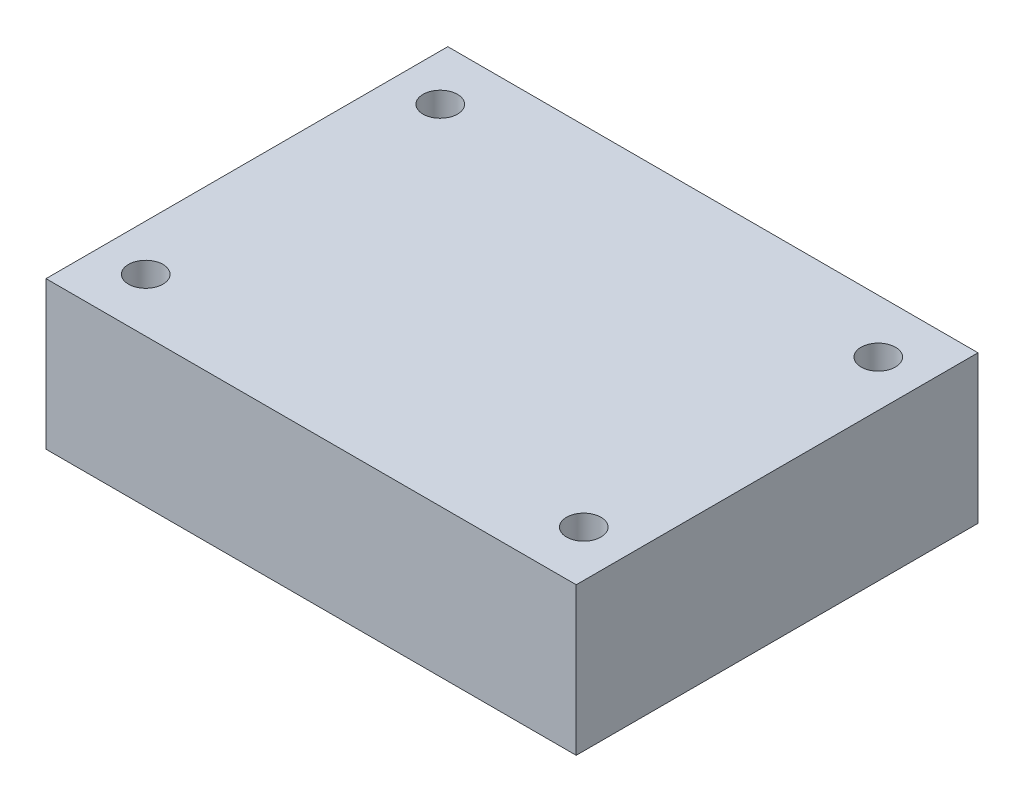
ISO-10303-21;
HEADER;
FILE_DESCRIPTION(('STEP AP214'),'2;1');
FILE_NAME('part.step','',(''),(''),'','','');
FILE_SCHEMA(('AUTOMOTIVE_DESIGN { 1 0 10303 214 1 1 1 1 }'));
ENDSEC;
DATA;
#1=APPLICATION_CONTEXT('core data for automotive mechanical design processes');
#2=APPLICATION_PROTOCOL_DEFINITION('international standard','automotive_design',2000,#1);
#3=PRODUCT_CONTEXT('',#1,'mechanical');
#4=PRODUCT('Part','Part','',(#3));
#5=PRODUCT_RELATED_PRODUCT_CATEGORY('part','',(#4));
#6=PRODUCT_DEFINITION_FORMATION('','',#4);
#7=PRODUCT_DEFINITION_CONTEXT('part definition',#1,'design');
#8=PRODUCT_DEFINITION('design','',#6,#7);
#9=PRODUCT_DEFINITION_SHAPE('','',#8);
#10=(LENGTH_UNIT() NAMED_UNIT(*) SI_UNIT(.MILLI.,.METRE.));
#11=(NAMED_UNIT(*) PLANE_ANGLE_UNIT() SI_UNIT($,.RADIAN.));
#12=(NAMED_UNIT(*) SI_UNIT($,.STERADIAN.) SOLID_ANGLE_UNIT());
#13=UNCERTAINTY_MEASURE_WITH_UNIT(LENGTH_MEASURE(1.E-05),#10,'distance_accuracy_value','');
#14=(GEOMETRIC_REPRESENTATION_CONTEXT(3) GLOBAL_UNCERTAINTY_ASSIGNED_CONTEXT((#13)) GLOBAL_UNIT_ASSIGNED_CONTEXT((#10,
#11,#12)) REPRESENTATION_CONTEXT('',''));
#15=CARTESIAN_POINT('',(0.,0.,0.));
#16=DIRECTION('',(0.,0.,1.));
#17=DIRECTION('',(1.,0.,0.));
#18=AXIS2_PLACEMENT_3D('',#15,#16,#17);
#19=CARTESIAN_POINT('',(73.3773642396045,40.894,-55.6055345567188));
#20=DIRECTION('',(-1.,0.,0.));
#21=DIRECTION('',(0.,0.,1.));
#22=AXIS2_PLACEMENT_3D('',#19,#20,#21);
#23=PLANE('',#22);
#24=DIRECTION('',(0.,0.,-1.));
#25=VECTOR('',#24,1.);
#26=CARTESIAN_POINT('',(73.3773642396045,0.,-55.6055345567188));
#27=LINE('',#26,#25);
#28=CARTESIAN_POINT('',(73.3773642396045,0.,55.6055345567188));
#29=VERTEX_POINT('',#28);
#30=CARTESIAN_POINT('',(73.3773642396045,0.,-55.6055345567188));
#31=VERTEX_POINT('',#30);
#32=EDGE_CURVE('E96',#29,#31,#27,.T.);
#33=ORIENTED_EDGE('',*,*,#32,.T.);
#34=DIRECTION('',(0.,-1.,0.));
#35=VECTOR('',#34,1.);
#36=CARTESIAN_POINT('',(73.3773642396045,40.894,-55.6055345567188));
#37=LINE('',#36,#35);
#38=CARTESIAN_POINT('',(73.3773642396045,40.894,-55.6055345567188));
#39=VERTEX_POINT('',#38);
#40=EDGE_CURVE('E11',#39,#31,#37,.T.);
#41=ORIENTED_EDGE('',*,*,#40,.F.);
#42=DIRECTION('',(0.,0.,-1.));
#43=VECTOR('',#42,1.);
#44=CARTESIAN_POINT('',(73.3773642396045,40.894,-55.6055345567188));
#45=LINE('',#44,#43);
#46=CARTESIAN_POINT('',(73.3773642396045,40.894,55.6055345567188));
#47=VERTEX_POINT('',#46);
#48=EDGE_CURVE('E84',#47,#39,#45,.T.);
#49=ORIENTED_EDGE('',*,*,#48,.F.);
#50=DIRECTION('',(0.,-1.,0.));
#51=VECTOR('',#50,1.);
#52=CARTESIAN_POINT('',(73.3773642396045,40.894,55.6055345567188));
#53=LINE('',#52,#51);
#54=EDGE_CURVE('E92',#47,#29,#53,.T.);
#55=ORIENTED_EDGE('',*,*,#54,.T.);
#56=EDGE_LOOP('',(#33,#41,#49,#55));
#57=FACE_BOUND('',#56,.T.);
#58=ADVANCED_FACE('F33',(#57),#23,.F.);
#59=CARTESIAN_POINT('',(-73.3773642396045,40.894,-55.6055345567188));
#60=DIRECTION('',(0.,0.,1.));
#61=DIRECTION('',(1.,0.,0.));
#62=AXIS2_PLACEMENT_3D('',#59,#60,#61);
#63=PLANE('',#62);
#64=DIRECTION('',(-1.,0.,0.));
#65=VECTOR('',#64,1.);
#66=CARTESIAN_POINT('',(-73.3773642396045,0.,-55.6055345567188));
#67=LINE('',#66,#65);
#68=CARTESIAN_POINT('',(-73.3773642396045,0.,-55.6055345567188));
#69=VERTEX_POINT('',#68);
#70=EDGE_CURVE('E88',#31,#69,#67,.T.);
#71=ORIENTED_EDGE('',*,*,#70,.T.);
#72=DIRECTION('',(0.,-1.,0.));
#73=VECTOR('',#72,1.);
#74=CARTESIAN_POINT('',(-73.3773642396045,40.894,-55.6055345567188));
#75=LINE('',#74,#73);
#76=CARTESIAN_POINT('',(-73.3773642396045,40.894,-55.6055345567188));
#77=VERTEX_POINT('',#76);
#78=EDGE_CURVE('E41',#77,#69,#75,.T.);
#79=ORIENTED_EDGE('',*,*,#78,.F.);
#80=DIRECTION('',(-1.,0.,0.));
#81=VECTOR('',#80,1.);
#82=CARTESIAN_POINT('',(-73.3773642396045,40.894,-55.6055345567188));
#83=LINE('',#82,#81);
#84=EDGE_CURVE('E79',#39,#77,#83,.T.);
#85=ORIENTED_EDGE('',*,*,#84,.F.);
#86=ORIENTED_EDGE('',*,*,#40,.T.);
#87=EDGE_LOOP('',(#71,#79,#85,#86));
#88=FACE_BOUND('',#87,.T.);
#89=ADVANCED_FACE('F87',(#88),#63,.F.);
#90=CARTESIAN_POINT('',(-73.3773642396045,40.894,-55.6055345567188));
#91=DIRECTION('',(1.,0.,0.));
#92=DIRECTION('',(0.,0.,-1.));
#93=AXIS2_PLACEMENT_3D('',#90,#91,#92);
#94=PLANE('',#93);
#95=DIRECTION('',(0.,0.,1.));
#96=VECTOR('',#95,1.);
#97=CARTESIAN_POINT('',(-73.3773642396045,0.,-55.6055345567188));
#98=LINE('',#97,#96);
#99=CARTESIAN_POINT('',(-73.3773642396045,0.,55.6055345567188));
#100=VERTEX_POINT('',#99);
#101=EDGE_CURVE('E66',#69,#100,#98,.T.);
#102=ORIENTED_EDGE('',*,*,#101,.T.);
#103=DIRECTION('',(0.,-1.,0.));
#104=VECTOR('',#103,1.);
#105=CARTESIAN_POINT('',(-73.3773642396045,40.894,55.6055345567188));
#106=LINE('',#105,#104);
#107=CARTESIAN_POINT('',(-73.3773642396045,40.894,55.6055345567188));
#108=VERTEX_POINT('',#107);
#109=EDGE_CURVE('E89',#108,#100,#106,.T.);
#110=ORIENTED_EDGE('',*,*,#109,.F.);
#111=DIRECTION('',(0.,0.,1.));
#112=VECTOR('',#111,1.);
#113=CARTESIAN_POINT('',(-73.3773642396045,40.894,-55.6055345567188));
#114=LINE('',#113,#112);
#115=EDGE_CURVE('E82',#77,#108,#114,.T.);
#116=ORIENTED_EDGE('',*,*,#115,.F.);
#117=ORIENTED_EDGE('',*,*,#78,.T.);
#118=EDGE_LOOP('',(#102,#110,#116,#117));
#119=FACE_BOUND('',#118,.T.);
#120=ADVANCED_FACE('F90',(#119),#94,.F.);
#121=CARTESIAN_POINT('',(-73.3773642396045,40.894,55.6055345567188));
#122=DIRECTION('',(0.,0.,-1.));
#123=DIRECTION('',(-1.,0.,0.));
#124=AXIS2_PLACEMENT_3D('',#121,#122,#123);
#125=PLANE('',#124);
#126=DIRECTION('',(1.,0.,0.));
#127=VECTOR('',#126,1.);
#128=CARTESIAN_POINT('',(-73.3773642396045,0.,55.6055345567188));
#129=LINE('',#128,#127);
#130=EDGE_CURVE('E72',#100,#29,#129,.T.);
#131=ORIENTED_EDGE('',*,*,#130,.T.);
#132=ORIENTED_EDGE('',*,*,#54,.F.);
#133=DIRECTION('',(1.,0.,0.));
#134=VECTOR('',#133,1.);
#135=CARTESIAN_POINT('',(-73.3773642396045,40.894,55.6055345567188));
#136=LINE('',#135,#134);
#137=EDGE_CURVE('E49',#108,#47,#136,.T.);
#138=ORIENTED_EDGE('',*,*,#137,.F.);
#139=ORIENTED_EDGE('',*,*,#109,.T.);
#140=EDGE_LOOP('',(#131,#132,#138,#139));
#141=FACE_BOUND('',#140,.T.);
#142=ADVANCED_FACE('F104',(#141),#125,.F.);
#143=CARTESIAN_POINT('',(0.,40.894,0.));
#144=DIRECTION('',(0.,1.,0.));
#145=DIRECTION('',(0.,0.,1.));
#146=AXIS2_PLACEMENT_3D('',#143,#144,#145);
#147=PLANE('',#146);
#148=CARTESIAN_POINT('',(60.617854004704,40.894,40.7604096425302));
#149=DIRECTION('',(0.,1.,0.));
#150=DIRECTION('',(0.,0.,1.));
#151=AXIS2_PLACEMENT_3D('',#148,#149,#150);
#152=CIRCLE('',#151,4.7625);
#153=CARTESIAN_POINT('',(60.617854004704,40.894,45.5229096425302));
#154=VERTEX_POINT('',#153);
#155=EDGE_CURVE('E128',#154,#154,#152,.T.);
#156=ORIENTED_EDGE('',*,*,#155,.F.);
#157=EDGE_LOOP('',(#156));
#158=FACE_BOUND('',#157,.T.);
#159=CARTESIAN_POINT('',(-60.617854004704,40.894,40.7604096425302));
#160=DIRECTION('',(0.,1.,0.));
#161=DIRECTION('',(0.,0.,-1.));
#162=AXIS2_PLACEMENT_3D('',#159,#160,#161);
#163=CIRCLE('',#162,4.7625);
#164=CARTESIAN_POINT('',(-60.617854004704,40.894,35.9979096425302));
#165=VERTEX_POINT('',#164);
#166=EDGE_CURVE('E122',#165,#165,#163,.T.);
#167=ORIENTED_EDGE('',*,*,#166,.F.);
#168=EDGE_LOOP('',(#167));
#169=FACE_BOUND('',#168,.T.);
#170=CARTESIAN_POINT('',(60.617854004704,40.894,-40.7604096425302));
#171=DIRECTION('',(0.,1.,0.));
#172=DIRECTION('',(0.,0.,-1.));
#173=AXIS2_PLACEMENT_3D('',#170,#171,#172);
#174=CIRCLE('',#173,4.7625);
#175=CARTESIAN_POINT('',(60.617854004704,40.894,-45.5229096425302));
#176=VERTEX_POINT('',#175);
#177=EDGE_CURVE('E116',#176,#176,#174,.T.);
#178=ORIENTED_EDGE('',*,*,#177,.F.);
#179=EDGE_LOOP('',(#178));
#180=FACE_BOUND('',#179,.T.);
#181=CARTESIAN_POINT('',(-60.617854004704,40.894,-40.7604096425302));
#182=DIRECTION('',(0.,1.,0.));
#183=DIRECTION('',(0.,0.,1.));
#184=AXIS2_PLACEMENT_3D('',#181,#182,#183);
#185=CIRCLE('',#184,4.7625);
#186=CARTESIAN_POINT('',(-60.617854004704,40.894,-35.9979096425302));
#187=VERTEX_POINT('',#186);
#188=EDGE_CURVE('E110',#187,#187,#185,.T.);
#189=ORIENTED_EDGE('',*,*,#188,.F.);
#190=EDGE_LOOP('',(#189));
#191=FACE_BOUND('',#190,.T.);
#192=ORIENTED_EDGE('',*,*,#48,.T.);
#193=ORIENTED_EDGE('',*,*,#84,.T.);
#194=ORIENTED_EDGE('',*,*,#115,.T.);
#195=ORIENTED_EDGE('',*,*,#137,.T.);
#196=EDGE_LOOP('',(#192,#193,#194,#195));
#197=FACE_BOUND('',#196,.T.);
#198=ADVANCED_FACE('F80',(#158,#169,#180,#191,#197),#147,.T.);
#199=CARTESIAN_POINT('',(0.,0.,0.));
#200=DIRECTION('',(0.,1.,0.));
#201=DIRECTION('',(0.,0.,1.));
#202=AXIS2_PLACEMENT_3D('',#199,#200,#201);
#203=PLANE('',#202);
#204=CARTESIAN_POINT('',(60.617854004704,0.,40.7604096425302));
#205=DIRECTION('',(0.,1.,0.));
#206=DIRECTION('',(0.,0.,1.));
#207=AXIS2_PLACEMENT_3D('',#204,#205,#206);
#208=CIRCLE('',#207,4.7625);
#209=CARTESIAN_POINT('',(60.617854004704,0.,45.5229096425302));
#210=VERTEX_POINT('',#209);
#211=EDGE_CURVE('E125',#210,#210,#208,.T.);
#212=ORIENTED_EDGE('',*,*,#211,.T.);
#213=EDGE_LOOP('',(#212));
#214=FACE_BOUND('',#213,.T.);
#215=CARTESIAN_POINT('',(-60.617854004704,0.,40.7604096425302));
#216=DIRECTION('',(0.,1.,0.));
#217=DIRECTION('',(0.,0.,-1.));
#218=AXIS2_PLACEMENT_3D('',#215,#216,#217);
#219=CIRCLE('',#218,4.7625);
#220=CARTESIAN_POINT('',(-60.617854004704,0.,35.9979096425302));
#221=VERTEX_POINT('',#220);
#222=EDGE_CURVE('E119',#221,#221,#219,.T.);
#223=ORIENTED_EDGE('',*,*,#222,.T.);
#224=EDGE_LOOP('',(#223));
#225=FACE_BOUND('',#224,.T.);
#226=CARTESIAN_POINT('',(60.617854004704,0.,-40.7604096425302));
#227=DIRECTION('',(0.,1.,0.));
#228=DIRECTION('',(0.,0.,-1.));
#229=AXIS2_PLACEMENT_3D('',#226,#227,#228);
#230=CIRCLE('',#229,4.7625);
#231=CARTESIAN_POINT('',(60.617854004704,0.,-45.5229096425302));
#232=VERTEX_POINT('',#231);
#233=EDGE_CURVE('E113',#232,#232,#230,.T.);
#234=ORIENTED_EDGE('',*,*,#233,.T.);
#235=EDGE_LOOP('',(#234));
#236=FACE_BOUND('',#235,.T.);
#237=CARTESIAN_POINT('',(-60.617854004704,0.,-40.7604096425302));
#238=DIRECTION('',(0.,1.,0.));
#239=DIRECTION('',(0.,0.,1.));
#240=AXIS2_PLACEMENT_3D('',#237,#238,#239);
#241=CIRCLE('',#240,4.7625);
#242=CARTESIAN_POINT('',(-60.617854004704,0.,-35.9979096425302));
#243=VERTEX_POINT('',#242);
#244=EDGE_CURVE('E99',#243,#243,#241,.T.);
#245=ORIENTED_EDGE('',*,*,#244,.T.);
#246=EDGE_LOOP('',(#245));
#247=FACE_BOUND('',#246,.T.);
#248=ORIENTED_EDGE('',*,*,#32,.F.);
#249=ORIENTED_EDGE('',*,*,#130,.F.);
#250=ORIENTED_EDGE('',*,*,#101,.F.);
#251=ORIENTED_EDGE('',*,*,#70,.F.);
#252=EDGE_LOOP('',(#248,#249,#250,#251));
#253=FACE_BOUND('',#252,.T.);
#254=ADVANCED_FACE('F107',(#214,#225,#236,#247,#253),#203,.F.);
#255=CARTESIAN_POINT('',(-60.617854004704,0.,-40.7604096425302));
#256=DIRECTION('',(0.,1.,0.));
#257=DIRECTION('',(0.,0.,1.));
#258=AXIS2_PLACEMENT_3D('',#255,#256,#257);
#259=CYLINDRICAL_SURFACE('',#258,4.7625);
#260=ORIENTED_EDGE('',*,*,#244,.F.);
#261=EDGE_LOOP('',(#260));
#262=FACE_BOUND('',#261,.T.);
#263=ORIENTED_EDGE('',*,*,#188,.T.);
#264=EDGE_LOOP('',(#263));
#265=FACE_BOUND('',#264,.T.);
#266=ADVANCED_FACE('F152',(#262,#265),#259,.F.);
#267=CARTESIAN_POINT('',(60.617854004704,0.,-40.7604096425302));
#268=DIRECTION('',(0.,1.,0.));
#269=DIRECTION('',(0.,0.,1.));
#270=AXIS2_PLACEMENT_3D('',#267,#268,#269);
#271=CYLINDRICAL_SURFACE('',#270,4.7625);
#272=ORIENTED_EDGE('',*,*,#233,.F.);
#273=EDGE_LOOP('',(#272));
#274=FACE_BOUND('',#273,.T.);
#275=ORIENTED_EDGE('',*,*,#177,.T.);
#276=EDGE_LOOP('',(#275));
#277=FACE_BOUND('',#276,.T.);
#278=ADVANCED_FACE('F154',(#274,#277),#271,.F.);
#279=CARTESIAN_POINT('',(-60.617854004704,0.,40.7604096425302));
#280=DIRECTION('',(0.,1.,0.));
#281=DIRECTION('',(0.,0.,1.));
#282=AXIS2_PLACEMENT_3D('',#279,#280,#281);
#283=CYLINDRICAL_SURFACE('',#282,4.7625);
#284=ORIENTED_EDGE('',*,*,#222,.F.);
#285=EDGE_LOOP('',(#284));
#286=FACE_BOUND('',#285,.T.);
#287=ORIENTED_EDGE('',*,*,#166,.T.);
#288=EDGE_LOOP('',(#287));
#289=FACE_BOUND('',#288,.T.);
#290=ADVANCED_FACE('F139',(#286,#289),#283,.F.);
#291=CARTESIAN_POINT('',(60.617854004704,0.,40.7604096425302));
#292=DIRECTION('',(0.,1.,0.));
#293=DIRECTION('',(0.,0.,1.));
#294=AXIS2_PLACEMENT_3D('',#291,#292,#293);
#295=CYLINDRICAL_SURFACE('',#294,4.7625);
#296=ORIENTED_EDGE('',*,*,#211,.F.);
#297=EDGE_LOOP('',(#296));
#298=FACE_BOUND('',#297,.T.);
#299=ORIENTED_EDGE('',*,*,#155,.T.);
#300=EDGE_LOOP('',(#299));
#301=FACE_BOUND('',#300,.T.);
#302=ADVANCED_FACE('F136',(#298,#301),#295,.F.);
#303=CLOSED_SHELL('',(#58,#89,#120,#142,#198,#254,#266,#278,#290,#302));
#304=MANIFOLD_SOLID_BREP('B2',#303);
#305=ADVANCED_BREP_SHAPE_REPRESENTATION('',(#18,#304),#14);
#306=SHAPE_DEFINITION_REPRESENTATION(#9,#305);
ENDSEC;
END-ISO-10303-21;
